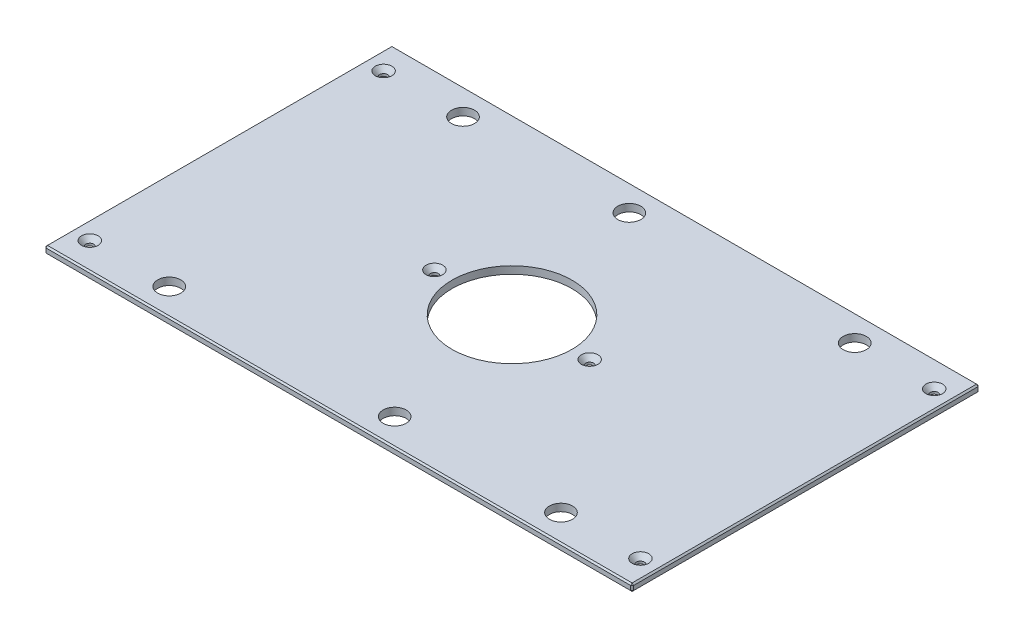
from build123d import *

# Parameters (mm, degrees)
SKETCH1_W                                     = 504.825
SKETCH1_H                                     = 298.45
BOSS_EXTRUDE1_DEPTH                           = 6.35
SKETCH13_R                                    = 51.562
CUT_EXTRUDE6_DEPTH                            = 294.292504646
F_25_32_0_78125_DIAMETER_HOLE1_D              = 19.84375
CHAMFER2_SIZE                                 = 1.27
CSK_FOR_1_4_FLAT_HEAD_MACHINE_SCREW1_AT_COUNT = 2
CSK_FOR_1_4_FLAT_HEAD_MACHINE_SCREW1_AT_PITCH = 252.40996
CSK_FOR_1_4_FLAT_HEAD_MACHINE_SCREW1_2_COUNT  = 2
CSK_FOR_1_4_FLAT_HEAD_MACHINE_SCREW1_2_PITCH  = 536.20028304
CSK_FOR_1_4_FLAT_HEAD_MACHINE_SCREW1_3_COUNT  = 2
CSK_FOR_1_4_FLAT_HEAD_MACHINE_SCREW1_3_PITCH  = 328.428861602
CSK_FOR_1_4_FLAT_HEAD_MACHINE_SCREW1_4_COUNT  = 2
CSK_FOR_1_4_FLAT_HEAD_MACHINE_SCREW1_4_PITCH  = 211.615136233
CSK_FOR_1_4_FLAT_HEAD_MACHINE_SCREW1_5_COUNT  = 2
CSK_FOR_1_4_FLAT_HEAD_MACHINE_SCREW1_5_PITCH  = 473.075
CSK_FOR_1_4_FLAT_HEAD_MACHINE_SCREW1_6_COUNT  = 2
CSK_FOR_1_4_FLAT_HEAD_MACHINE_SCREW1_6_PITCH  = 404.8125
CSK_FOR_1_4_FLAT_HEAD_MACHINE_SCREW1_7_COUNT  = 2
CSK_FOR_1_4_FLAT_HEAD_MACHINE_SCREW1_7_PITCH  = 477.057594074


with BuildPart() as part:
    # Sketch1 → Boss-Extrude1 (new body)
    with BuildSketch(Plane(origin=(0, 0, 0), x_dir=(1, 0, 0), z_dir=(0, 1, 0))):
        Rectangle(SKETCH1_W, SKETCH1_H)
    extrude(amount=BOSS_EXTRUDE1_DEPTH)

    # Sketch13 → Cut-Extrude6 (cut, through all)
    with BuildSketch(Plane(origin=(0, 6.35, 0), x_dir=(1, 0, 0), z_dir=(0, 1, 0))):
        with Locations(Location((0, 0, 0), (0, 0, 270))):
            Circle(SKETCH13_R)
    extrude(amount=-CUT_EXTRUDE6_DEPTH, mode=Mode.SUBTRACT)

    # 25_32 _0.78125_ Diameter Hole1 (through all)
    with Locations(Plane(origin=(0, 6.35, 0), x_dir=(1, 0, 0), z_dir=(0, 1, 0))):
        with Locations((168.275, 126.20498), (-168.275, 126.20498), (168.275, -126.20498), (-168.275, -126.20498), (-25.4, 126.20498), (25.4, -126.20498)):
            Hole(F_25_32_0_78125_DIAMETER_HOLE1_D / 2)

    # Chamfer2
    chamfer2_edges = [part.edges().sort_by_distance(p)[0] for p in [
        (252.4125, 6.35, 0),
        (0, 6.35, -149.225),
        (-252.4125, 6.35, 0),
        (0, 0, -149.225),
        (252.4125, 0, 0),
        (0, 0, 149.225),
        (-252.4125, 0, 0),
        (0, 6.35, 149.225),
        (-252.4125, 3.175, -149.225),
        (252.4125, 3.175, -149.225),
        (252.4125, 3.175, 149.225),
        (-252.4125, 3.175, 149.225),
    ]]
    chamfer(chamfer2_edges, length=CHAMFER2_SIZE)

    # Sketch24 → CSK for 1_4 Flat Head Machine Screw1 (revolve, cut)
    with BuildSketch(Plane(origin=(236.5375, 6.35, -126.20498), x_dir=(0, 0, 1), z_dir=(1, 0, 0))):
        Polygon((0, 0), (0, 6.35), (3.3782, 6.35), (3.3782, 4.324464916), (7.1374, 0), align=None)
    csk_for_1_4_flat_head_machine_screw1 = revolve(axis=Axis((236.5375, 12.7, -126.20498), (0, -1, 0)), mode=Mode.SUBTRACT)

    # CSK for 1_4 Flat Head Machine Screw1 at: CSK for 1_4 Flat Head Machine Screw1 ×2
    with Locations(*[(0, 0, i * CSK_FOR_1_4_FLAT_HEAD_MACHINE_SCREW1_AT_PITCH) for i in range(1, CSK_FOR_1_4_FLAT_HEAD_MACHINE_SCREW1_AT_COUNT)]):
        add(csk_for_1_4_flat_head_machine_screw1, mode=Mode.SUBTRACT)

    # CSK for 1_4 Flat Head Machine Screw1 2: CSK for 1_4 Flat Head Machine Screw1 ×2
    with Locations(*[Vector(-0.8822729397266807, 0, 0.4707382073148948) * (i * CSK_FOR_1_4_FLAT_HEAD_MACHINE_SCREW1_2_PITCH) for i in range(1, CSK_FOR_1_4_FLAT_HEAD_MACHINE_SCREW1_2_COUNT)]):
        add(csk_for_1_4_flat_head_machine_screw1, mode=Mode.SUBTRACT)

    # CSK for 1_4 Flat Head Machine Screw1 3: CSK for 1_4 Flat Head Machine Screw1 ×2
    with Locations(*[Vector(-0.9232212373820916, 0, 0.3842688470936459) * (i * CSK_FOR_1_4_FLAT_HEAD_MACHINE_SCREW1_3_PITCH) for i in range(1, CSK_FOR_1_4_FLAT_HEAD_MACHINE_SCREW1_3_COUNT)]):
        add(csk_for_1_4_flat_head_machine_screw1, mode=Mode.SUBTRACT)

    # CSK for 1_4 Flat Head Machine Screw1 4: CSK for 1_4 Flat Head Machine Screw1 ×2
    with Locations(*[Vector(-0.8026954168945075, 0, 0.5963891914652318) * (i * CSK_FOR_1_4_FLAT_HEAD_MACHINE_SCREW1_4_PITCH) for i in range(1, CSK_FOR_1_4_FLAT_HEAD_MACHINE_SCREW1_4_COUNT)]):
        add(csk_for_1_4_flat_head_machine_screw1, mode=Mode.SUBTRACT)

    # CSK for 1_4 Flat Head Machine Screw1 5: CSK for 1_4 Flat Head Machine Screw1 ×2
    with Locations(*[(-i * CSK_FOR_1_4_FLAT_HEAD_MACHINE_SCREW1_5_PITCH, 0, 0) for i in range(1, CSK_FOR_1_4_FLAT_HEAD_MACHINE_SCREW1_5_COUNT)]):
        add(csk_for_1_4_flat_head_machine_screw1, mode=Mode.SUBTRACT)

    # CSK for 1_4 Flat Head Machine Screw1 6: CSK for 1_4 Flat Head Machine Screw1 ×2
    with Locations(*[(-i * CSK_FOR_1_4_FLAT_HEAD_MACHINE_SCREW1_6_PITCH, 0, 0) for i in range(1, CSK_FOR_1_4_FLAT_HEAD_MACHINE_SCREW1_6_COUNT)]):
        add(csk_for_1_4_flat_head_machine_screw1, mode=Mode.SUBTRACT)

    # CSK for 1_4 Flat Head Machine Screw1 7: CSK for 1_4 Flat Head Machine Screw1 ×2
    with Locations(*[Vector(-0.8485610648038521, 0, 0.5290974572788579) * (i * CSK_FOR_1_4_FLAT_HEAD_MACHINE_SCREW1_7_PITCH) for i in range(1, CSK_FOR_1_4_FLAT_HEAD_MACHINE_SCREW1_7_COUNT)]):
        add(csk_for_1_4_flat_head_machine_screw1, mode=Mode.SUBTRACT)


solid = part.part
